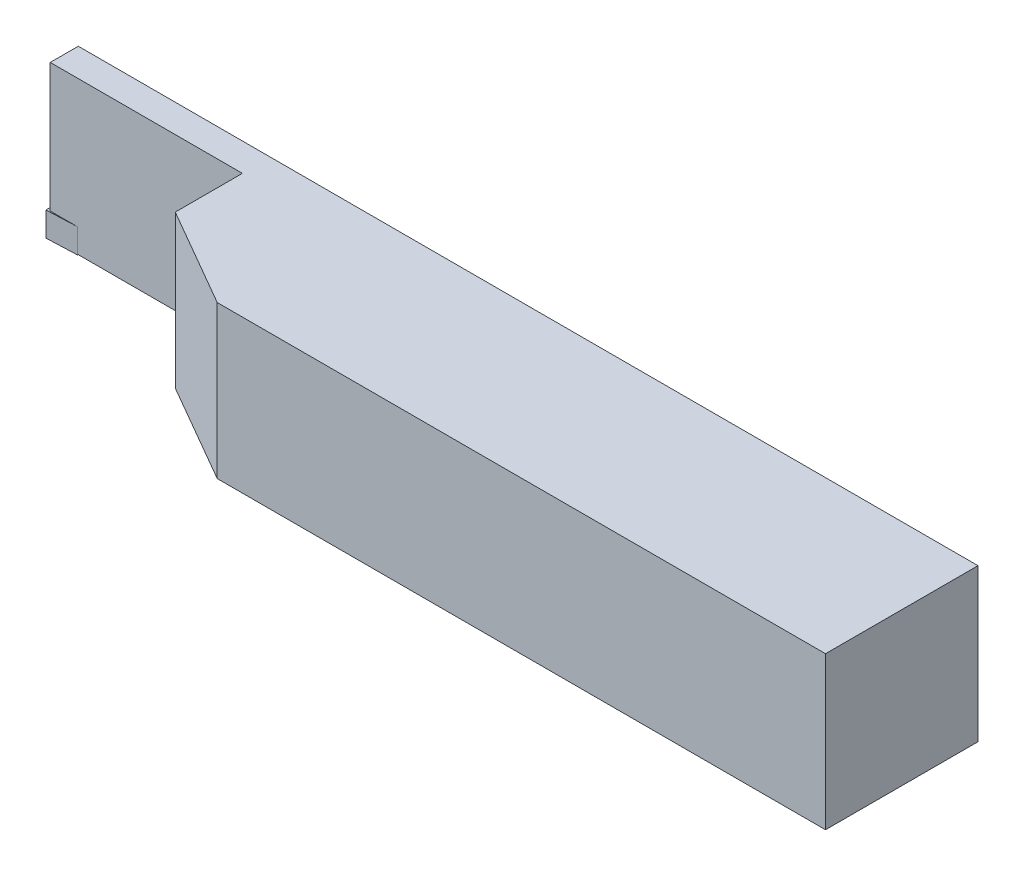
from build123d import *

# Parameters (mm, degrees)
PLAQUETTE_DEPTH  = 4
CORPSOUTIL_DEPTH = 25


with BuildPart() as part:
    # EsqPlaquette → Plaquette (new body)
    with BuildSketch(Plane(origin=(0, 0, 0), x_dir=(1, 0, 0), z_dir=(0, 1, 0))):
        with BuildLine():
            Line((0, -0.010407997), (0, -4.989592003))
            ThreePointArc((0, -4.989592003), (0.003071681, -4.996802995), (0.01039968, -4.999584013))
            Line((0.01039968, -4.999584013), (4.99039968, -4.800384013))
            ThreePointArc((4.99039968, -4.800384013), (4.997210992, -4.797320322), (5, -4.790392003))
            Line((5, -4.790392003), (5, -0.209607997))
            ThreePointArc((5, -0.209607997), (4.997210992, -0.202679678), (4.99039968, -0.199615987))
            Line((4.99039968, -0.199615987), (0.01039968, -0.000415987))
            ThreePointArc((0.01039968, -0.000415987), (0.003071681, -0.003197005), (0, -0.010407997))
        make_face()
    extrude(amount=PLAQUETTE_DEPTH)

    # EsqCorps → CorpsOutil (add)
    with BuildSketch(Plane(origin=(0, 0.1, 0), x_dir=(-1, 0, 0), z_dir=(0, 1, 0))):
        Polygon((-0.5, 0.2), (-148, 0.2), (-148, 25.2), (-48.281277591, 25.2), (-32, 15.8), (-32, 4.8), (-0.5, 4.8), align=None)
    extrude(amount=CORPSOUTIL_DEPTH)


solid = part.part
